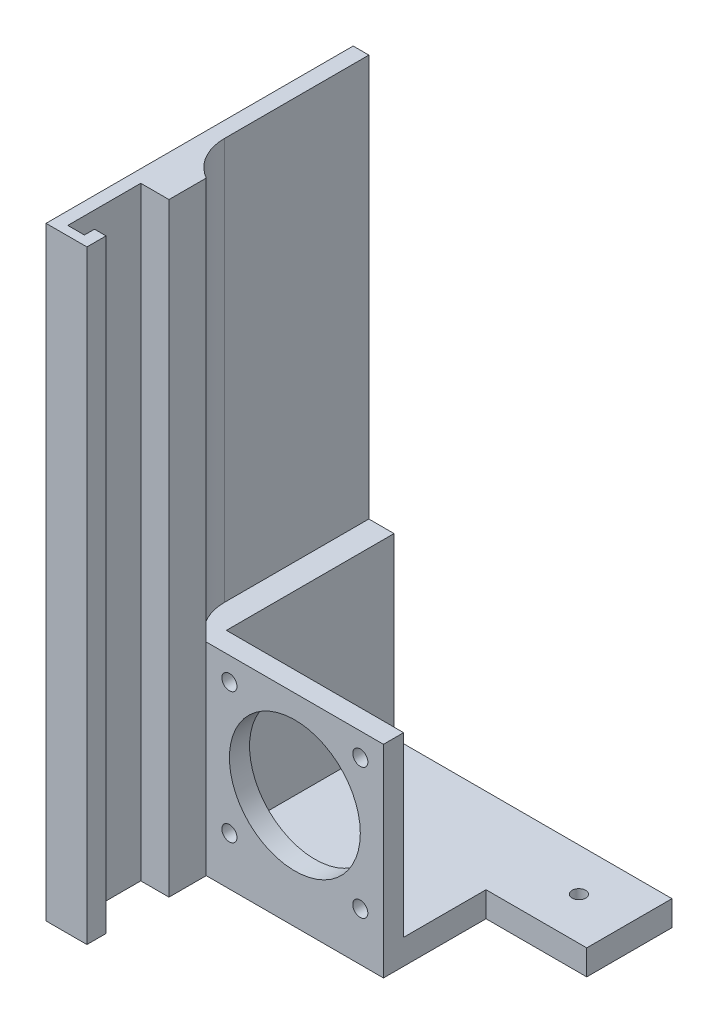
ISO-10303-21;
HEADER;
FILE_DESCRIPTION(('STEP AP214'),'2;1');
FILE_NAME('part.step','',(''),(''),'','','');
FILE_SCHEMA(('AUTOMOTIVE_DESIGN { 1 0 10303 214 1 1 1 1 }'));
ENDSEC;
DATA;
#1=APPLICATION_CONTEXT('core data for automotive mechanical design processes');
#2=APPLICATION_PROTOCOL_DEFINITION('international standard','automotive_design',2000,#1);
#3=PRODUCT_CONTEXT('',#1,'mechanical');
#4=PRODUCT('Part','Part','',(#3));
#5=PRODUCT_RELATED_PRODUCT_CATEGORY('part','',(#4));
#6=PRODUCT_DEFINITION_FORMATION('','',#4);
#7=PRODUCT_DEFINITION_CONTEXT('part definition',#1,'design');
#8=PRODUCT_DEFINITION('design','',#6,#7);
#9=PRODUCT_DEFINITION_SHAPE('','',#8);
#10=(LENGTH_UNIT() NAMED_UNIT(*) SI_UNIT(.MILLI.,.METRE.));
#11=(NAMED_UNIT(*) PLANE_ANGLE_UNIT() SI_UNIT($,.RADIAN.));
#12=(NAMED_UNIT(*) SI_UNIT($,.STERADIAN.) SOLID_ANGLE_UNIT());
#13=UNCERTAINTY_MEASURE_WITH_UNIT(LENGTH_MEASURE(1.E-05),#10,'distance_accuracy_value','');
#14=(GEOMETRIC_REPRESENTATION_CONTEXT(3) GLOBAL_UNCERTAINTY_ASSIGNED_CONTEXT((#13)) GLOBAL_UNIT_ASSIGNED_CONTEXT((#10,
#11,#12)) REPRESENTATION_CONTEXT('',''));
#15=CARTESIAN_POINT('',(0.,0.,0.));
#16=DIRECTION('',(0.,0.,1.));
#17=DIRECTION('',(1.,0.,0.));
#18=AXIS2_PLACEMENT_3D('',#15,#16,#17);
#19=CARTESIAN_POINT('',(-25.72,0.,0.));
#20=DIRECTION('',(1.,0.,0.));
#21=DIRECTION('',(0.,1.,0.));
#22=AXIS2_PLACEMENT_3D('',#19,#20,#21);
#23=PLANE('',#22);
#24=DIRECTION('',(0.,0.,-1.));
#25=VECTOR('',#24,1.);
#26=CARTESIAN_POINT('',(-25.72,-17.6,-33.3));
#27=LINE('',#26,#25);
#28=CARTESIAN_POINT('',(-25.72,-17.6,-16.37));
#29=VERTEX_POINT('',#28);
#30=CARTESIAN_POINT('',(-25.72,-17.6,-33.3));
#31=VERTEX_POINT('',#30);
#32=EDGE_CURVE('E218',#29,#31,#27,.T.);
#33=ORIENTED_EDGE('',*,*,#32,.F.);
#34=DIRECTION('',(0.,1.,0.));
#35=VECTOR('',#34,1.);
#36=CARTESIAN_POINT('',(-25.72,-17.6,-16.37));
#37=LINE('',#36,#35);
#38=CARTESIAN_POINT('',(-25.72,-22.6,-16.37));
#39=VERTEX_POINT('',#38);
#40=EDGE_CURVE('E54',#39,#29,#37,.T.);
#41=ORIENTED_EDGE('',*,*,#40,.F.);
#42=DIRECTION('',(0.,0.,1.));
#43=VECTOR('',#42,1.);
#44=CARTESIAN_POINT('',(-25.72,-22.6,-33.3));
#45=LINE('',#44,#43);
#46=CARTESIAN_POINT('',(-25.72,-22.6,27.7));
#47=VERTEX_POINT('',#46);
#48=EDGE_CURVE('E329',#39,#47,#45,.T.);
#49=ORIENTED_EDGE('',*,*,#48,.T.);
#50=DIRECTION('',(0.,-1.,0.));
#51=VECTOR('',#50,1.);
#52=CARTESIAN_POINT('',(-25.72,157.4,27.7));
#53=LINE('',#52,#51);
#54=CARTESIAN_POINT('',(-25.72,97.4,27.7));
#55=VERTEX_POINT('',#54);
#56=EDGE_CURVE('E321',#55,#47,#53,.T.);
#57=ORIENTED_EDGE('',*,*,#56,.F.);
#58=DIRECTION('',(0.,0.,-1.));
#59=VECTOR('',#58,1.);
#60=CARTESIAN_POINT('',(-25.72,97.4,0.));
#61=LINE('',#60,#59);
#62=CARTESIAN_POINT('',(-25.72,97.4,-33.3));
#63=VERTEX_POINT('',#62);
#64=EDGE_CURVE('E281',#55,#63,#61,.T.);
#65=ORIENTED_EDGE('',*,*,#64,.T.);
#66=DIRECTION('',(0.,-1.,0.));
#67=VECTOR('',#66,1.);
#68=CARTESIAN_POINT('',(-25.72,-22.6,-33.3));
#69=LINE('',#68,#67);
#70=EDGE_CURVE('E60',#63,#31,#69,.T.);
#71=ORIENTED_EDGE('',*,*,#70,.T.);
#72=EDGE_LOOP('',(#33,#41,#49,#57,#65,#71));
#73=FACE_BOUND('',#72,.T.);
#74=ADVANCED_FACE('F39',(#73),#23,.F.);
#75=CARTESIAN_POINT('',(17.6,17.6,4.));
#76=DIRECTION('',(-1.,0.,0.));
#77=DIRECTION('',(0.,-1.,0.));
#78=AXIS2_PLACEMENT_3D('',#75,#76,#77);
#79=PLANE('',#78);
#80=DIRECTION('',(0.,-1.,0.));
#81=VECTOR('',#80,1.);
#82=CARTESIAN_POINT('',(17.6,-17.6,-16.37));
#83=LINE('',#82,#81);
#84=CARTESIAN_POINT('',(17.6,-17.6,-16.37));
#85=VERTEX_POINT('',#84);
#86=CARTESIAN_POINT('',(17.6,-22.6,-16.37));
#87=VERTEX_POINT('',#86);
#88=EDGE_CURVE('E240',#85,#87,#83,.T.);
#89=ORIENTED_EDGE('',*,*,#88,.F.);
#90=DIRECTION('',(0.,0.,-1.));
#91=VECTOR('',#90,1.);
#92=CARTESIAN_POINT('',(17.6,-17.6,4.));
#93=LINE('',#92,#91);
#94=CARTESIAN_POINT('',(17.6,-17.6,0.));
#95=VERTEX_POINT('',#94);
#96=EDGE_CURVE('E343',#95,#85,#93,.T.);
#97=ORIENTED_EDGE('',*,*,#96,.F.);
#98=DIRECTION('',(0.,1.,0.));
#99=VECTOR('',#98,1.);
#100=CARTESIAN_POINT('',(17.6,17.6,0.));
#101=LINE('',#100,#99);
#102=CARTESIAN_POINT('',(17.6,17.6,0.));
#103=VERTEX_POINT('',#102);
#104=EDGE_CURVE('E381',#95,#103,#101,.T.);
#105=ORIENTED_EDGE('',*,*,#104,.T.);
#106=DIRECTION('',(0.,0.,-1.));
#107=VECTOR('',#106,1.);
#108=CARTESIAN_POINT('',(17.6,17.6,4.));
#109=LINE('',#108,#107);
#110=CARTESIAN_POINT('',(17.6,17.6,4.));
#111=VERTEX_POINT('',#110);
#112=EDGE_CURVE('E391',#111,#103,#109,.T.);
#113=ORIENTED_EDGE('',*,*,#112,.F.);
#114=DIRECTION('',(0.,1.,0.));
#115=VECTOR('',#114,1.);
#116=CARTESIAN_POINT('',(17.6,17.6,4.));
#117=LINE('',#116,#115);
#118=CARTESIAN_POINT('',(17.6,-22.6,4.));
#119=VERTEX_POINT('',#118);
#120=EDGE_CURVE('E384',#119,#111,#117,.T.);
#121=ORIENTED_EDGE('',*,*,#120,.F.);
#122=DIRECTION('',(0.,0.,-1.));
#123=VECTOR('',#122,1.);
#124=CARTESIAN_POINT('',(17.6,-22.6,4.));
#125=LINE('',#124,#123);
#126=EDGE_CURVE('E202',#119,#87,#125,.T.);
#127=ORIENTED_EDGE('',*,*,#126,.T.);
#128=EDGE_LOOP('',(#89,#97,#105,#113,#121,#127));
#129=FACE_BOUND('',#128,.T.);
#130=ADVANCED_FACE('F464',(#129),#79,.F.);
#131=CARTESIAN_POINT('',(-22.6,0.,0.));
#132=DIRECTION('',(1.,0.,0.));
#133=DIRECTION('',(0.,1.,0.));
#134=AXIS2_PLACEMENT_3D('',#131,#132,#133);
#135=PLANE('',#134);
#136=DIRECTION('',(0.,0.,-1.));
#137=VECTOR('',#136,1.);
#138=CARTESIAN_POINT('',(-22.6,97.4,0.));
#139=LINE('',#138,#137);
#140=CARTESIAN_POINT('',(-22.6,97.4,-4.66025403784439));
#141=VERTEX_POINT('',#140);
#142=CARTESIAN_POINT('',(-22.6,97.4,-33.3));
#143=VERTEX_POINT('',#142);
#144=EDGE_CURVE('E279',#141,#143,#139,.T.);
#145=ORIENTED_EDGE('',*,*,#144,.F.);
#146=DIRECTION('',(0.,-1.,0.));
#147=VECTOR('',#146,1.);
#148=CARTESIAN_POINT('',(-22.6,17.6,-4.66025403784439));
#149=LINE('',#148,#147);
#150=CARTESIAN_POINT('',(-22.6,17.6,-4.66025403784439));
#151=VERTEX_POINT('',#150);
#152=EDGE_CURVE('E403',#141,#151,#149,.T.);
#153=ORIENTED_EDGE('',*,*,#152,.T.);
#154=DIRECTION('',(0.,0.,-1.));
#155=VECTOR('',#154,1.);
#156=CARTESIAN_POINT('',(-22.6,17.6,4.));
#157=LINE('',#156,#155);
#158=CARTESIAN_POINT('',(-22.6,17.6,-33.3));
#159=VERTEX_POINT('',#158);
#160=EDGE_CURVE('E333',#151,#159,#157,.T.);
#161=ORIENTED_EDGE('',*,*,#160,.T.);
#162=DIRECTION('',(0.,-1.,0.));
#163=VECTOR('',#162,1.);
#164=CARTESIAN_POINT('',(-22.6,-22.6,-33.3));
#165=LINE('',#164,#163);
#166=EDGE_CURVE('E327',#143,#159,#165,.T.);
#167=ORIENTED_EDGE('',*,*,#166,.F.);
#168=EDGE_LOOP('',(#145,#153,#161,#167));
#169=FACE_BOUND('',#168,.T.);
#170=ADVANCED_FACE('F429',(#169),#135,.T.);
#171=CARTESIAN_POINT('',(0.,0.,4.));
#172=DIRECTION('',(0.,0.,1.));
#173=DIRECTION('',(1.,0.,0.));
#174=AXIS2_PLACEMENT_3D('',#171,#172,#173);
#175=PLANE('',#174);
#176=DIRECTION('',(0.,1.,0.));
#177=VECTOR('',#176,1.);
#178=CARTESIAN_POINT('',(-17.6,-22.6,4.));
#179=LINE('',#178,#177);
#180=CARTESIAN_POINT('',(-17.6,-22.6,4.));
#181=VERTEX_POINT('',#180);
#182=CARTESIAN_POINT('',(-17.6,17.6,4.));
#183=VERTEX_POINT('',#182);
#184=EDGE_CURVE('E301',#181,#183,#179,.T.);
#185=ORIENTED_EDGE('',*,*,#184,.F.);
#186=DIRECTION('',(1.,0.,0.));
#187=VECTOR('',#186,1.);
#188=CARTESIAN_POINT('',(-17.6,-22.6,4.));
#189=LINE('',#188,#187);
#190=EDGE_CURVE('E344',#181,#119,#189,.T.);
#191=ORIENTED_EDGE('',*,*,#190,.T.);
#192=ORIENTED_EDGE('',*,*,#120,.T.);
#193=DIRECTION('',(-1.,0.,0.));
#194=VECTOR('',#193,1.);
#195=CARTESIAN_POINT('',(-17.6,17.6,4.));
#196=LINE('',#195,#194);
#197=EDGE_CURVE('E387',#111,#183,#196,.T.);
#198=ORIENTED_EDGE('',*,*,#197,.T.);
#199=EDGE_LOOP('',(#185,#191,#192,#198));
#200=FACE_BOUND('',#199,.T.);
#201=CARTESIAN_POINT('',(12.9966226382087,12.9966226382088,4.));
#202=DIRECTION('',(0.,0.,1.));
#203=DIRECTION('',(1.,0.,0.));
#204=AXIS2_PLACEMENT_3D('',#201,#202,#203);
#205=CIRCLE('',#204,1.5);
#206=CARTESIAN_POINT('',(14.4966226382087,12.9966226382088,4.));
#207=VERTEX_POINT('',#206);
#208=EDGE_CURVE('E360',#207,#207,#205,.T.);
#209=ORIENTED_EDGE('',*,*,#208,.F.);
#210=EDGE_LOOP('',(#209));
#211=FACE_BOUND('',#210,.T.);
#212=CARTESIAN_POINT('',(12.9966226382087,-12.9966226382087,4.));
#213=DIRECTION('',(0.,0.,1.));
#214=DIRECTION('',(1.,0.,0.));
#215=AXIS2_PLACEMENT_3D('',#212,#213,#214);
#216=CIRCLE('',#215,1.5);
#217=CARTESIAN_POINT('',(14.4966226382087,-12.9966226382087,4.));
#218=VERTEX_POINT('',#217);
#219=EDGE_CURVE('E372',#218,#218,#216,.T.);
#220=ORIENTED_EDGE('',*,*,#219,.F.);
#221=EDGE_LOOP('',(#220));
#222=FACE_BOUND('',#221,.T.);
#223=CARTESIAN_POINT('',(-12.9966226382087,-12.9966226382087,4.));
#224=DIRECTION('',(0.,0.,1.));
#225=DIRECTION('',(1.,0.,0.));
#226=AXIS2_PLACEMENT_3D('',#223,#224,#225);
#227=CIRCLE('',#226,1.5);
#228=CARTESIAN_POINT('',(-11.4966226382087,-12.9966226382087,4.));
#229=VERTEX_POINT('',#228);
#230=EDGE_CURVE('E378',#229,#229,#227,.T.);
#231=ORIENTED_EDGE('',*,*,#230,.F.);
#232=EDGE_LOOP('',(#231));
#233=FACE_BOUND('',#232,.T.);
#234=CARTESIAN_POINT('',(-12.9966226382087,12.9966226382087,4.));
#235=DIRECTION('',(0.,0.,1.));
#236=DIRECTION('',(1.,0.,0.));
#237=AXIS2_PLACEMENT_3D('',#234,#235,#236);
#238=CIRCLE('',#237,1.5);
#239=CARTESIAN_POINT('',(-11.4966226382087,12.9966226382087,4.));
#240=VERTEX_POINT('',#239);
#241=EDGE_CURVE('E366',#240,#240,#238,.T.);
#242=ORIENTED_EDGE('',*,*,#241,.F.);
#243=EDGE_LOOP('',(#242));
#244=FACE_BOUND('',#243,.T.);
#245=CARTESIAN_POINT('',(0.,0.,4.));
#246=DIRECTION('',(0.,0.,1.));
#247=DIRECTION('',(1.,0.,0.));
#248=AXIS2_PLACEMENT_3D('',#245,#246,#247);
#249=CIRCLE('',#248,13.);
#250=CARTESIAN_POINT('',(13.,0.,4.));
#251=VERTEX_POINT('',#250);
#252=EDGE_CURVE('E354',#251,#251,#249,.T.);
#253=ORIENTED_EDGE('',*,*,#252,.F.);
#254=EDGE_LOOP('',(#253));
#255=FACE_BOUND('',#254,.T.);
#256=ADVANCED_FACE('F420',(#200,#211,#222,#233,#244,#255),#175,.T.);
#257=CARTESIAN_POINT('',(0.,0.,0.));
#258=DIRECTION('',(0.,0.,1.));
#259=DIRECTION('',(1.,0.,0.));
#260=AXIS2_PLACEMENT_3D('',#257,#258,#259);
#261=PLANE('',#260);
#262=ORIENTED_EDGE('',*,*,#104,.F.);
#263=DIRECTION('',(1.,0.,0.));
#264=VECTOR('',#263,1.);
#265=CARTESIAN_POINT('',(-17.6,-17.6,0.));
#266=LINE('',#265,#264);
#267=CARTESIAN_POINT('',(-17.6,-17.6,0.));
#268=VERTEX_POINT('',#267);
#269=EDGE_CURVE('E388',#268,#95,#266,.T.);
#270=ORIENTED_EDGE('',*,*,#269,.F.);
#271=DIRECTION('',(0.,-1.,0.));
#272=VECTOR('',#271,1.);
#273=CARTESIAN_POINT('',(-17.6,17.6,0.));
#274=LINE('',#273,#272);
#275=CARTESIAN_POINT('',(-17.6,17.6,0.));
#276=VERTEX_POINT('',#275);
#277=EDGE_CURVE('E396',#276,#268,#274,.T.);
#278=ORIENTED_EDGE('',*,*,#277,.F.);
#279=DIRECTION('',(-1.,0.,0.));
#280=VECTOR('',#279,1.);
#281=CARTESIAN_POINT('',(-17.6,17.6,0.));
#282=LINE('',#281,#280);
#283=EDGE_CURVE('E394',#103,#276,#282,.T.);
#284=ORIENTED_EDGE('',*,*,#283,.F.);
#285=EDGE_LOOP('',(#262,#270,#278,#284));
#286=FACE_BOUND('',#285,.T.);
#287=CARTESIAN_POINT('',(-12.9966226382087,-12.9966226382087,0.));
#288=DIRECTION('',(0.,0.,1.));
#289=DIRECTION('',(1.,0.,0.));
#290=AXIS2_PLACEMENT_3D('',#287,#288,#289);
#291=CIRCLE('',#290,1.5);
#292=CARTESIAN_POINT('',(-11.4966226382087,-12.9966226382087,0.));
#293=VERTEX_POINT('',#292);
#294=EDGE_CURVE('E375',#293,#293,#291,.T.);
#295=ORIENTED_EDGE('',*,*,#294,.T.);
#296=EDGE_LOOP('',(#295));
#297=FACE_BOUND('',#296,.T.);
#298=CARTESIAN_POINT('',(12.9966226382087,-12.9966226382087,0.));
#299=DIRECTION('',(0.,0.,1.));
#300=DIRECTION('',(1.,0.,0.));
#301=AXIS2_PLACEMENT_3D('',#298,#299,#300);
#302=CIRCLE('',#301,1.5);
#303=CARTESIAN_POINT('',(14.4966226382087,-12.9966226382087,0.));
#304=VERTEX_POINT('',#303);
#305=EDGE_CURVE('E369',#304,#304,#302,.T.);
#306=ORIENTED_EDGE('',*,*,#305,.T.);
#307=EDGE_LOOP('',(#306));
#308=FACE_BOUND('',#307,.T.);
#309=CARTESIAN_POINT('',(-12.9966226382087,12.9966226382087,0.));
#310=DIRECTION('',(0.,0.,1.));
#311=DIRECTION('',(1.,0.,0.));
#312=AXIS2_PLACEMENT_3D('',#309,#310,#311);
#313=CIRCLE('',#312,1.5);
#314=CARTESIAN_POINT('',(-11.4966226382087,12.9966226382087,0.));
#315=VERTEX_POINT('',#314);
#316=EDGE_CURVE('E363',#315,#315,#313,.T.);
#317=ORIENTED_EDGE('',*,*,#316,.T.);
#318=EDGE_LOOP('',(#317));
#319=FACE_BOUND('',#318,.T.);
#320=CARTESIAN_POINT('',(12.9966226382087,12.9966226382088,0.));
#321=DIRECTION('',(0.,0.,1.));
#322=DIRECTION('',(1.,0.,0.));
#323=AXIS2_PLACEMENT_3D('',#320,#321,#322);
#324=CIRCLE('',#323,1.5);
#325=CARTESIAN_POINT('',(14.4966226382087,12.9966226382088,0.));
#326=VERTEX_POINT('',#325);
#327=EDGE_CURVE('E357',#326,#326,#324,.T.);
#328=ORIENTED_EDGE('',*,*,#327,.T.);
#329=EDGE_LOOP('',(#328));
#330=FACE_BOUND('',#329,.T.);
#331=CARTESIAN_POINT('',(0.,0.,0.));
#332=DIRECTION('',(0.,0.,1.));
#333=DIRECTION('',(1.,0.,0.));
#334=AXIS2_PLACEMENT_3D('',#331,#332,#333);
#335=CIRCLE('',#334,13.);
#336=CARTESIAN_POINT('',(13.,0.,0.));
#337=VERTEX_POINT('',#336);
#338=EDGE_CURVE('E201',#337,#337,#335,.T.);
#339=ORIENTED_EDGE('',*,*,#338,.T.);
#340=EDGE_LOOP('',(#339));
#341=FACE_BOUND('',#340,.T.);
#342=ADVANCED_FACE('F469',(#286,#297,#308,#319,#330,#341),#261,.F.);
#343=CARTESIAN_POINT('',(-17.6,17.6,4.));
#344=DIRECTION('',(0.,-1.,0.));
#345=DIRECTION('',(0.,0.,-1.));
#346=AXIS2_PLACEMENT_3D('',#343,#344,#345);
#347=PLANE('',#346);
#348=ORIENTED_EDGE('',*,*,#160,.F.);
#349=CARTESIAN_POINT('',(-12.6,17.6,-4.66025403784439));
#350=DIRECTION('',(0.,-1.,0.));
#351=DIRECTION('',(0.,0.,-1.));
#352=AXIS2_PLACEMENT_3D('',#349,#350,#351);
#353=CIRCLE('',#352,10.);
#354=EDGE_CURVE('E47',#151,#183,#353,.F.);
#355=ORIENTED_EDGE('',*,*,#354,.T.);
#356=ORIENTED_EDGE('',*,*,#197,.F.);
#357=ORIENTED_EDGE('',*,*,#112,.T.);
#358=ORIENTED_EDGE('',*,*,#283,.T.);
#359=DIRECTION('',(0.,0.,-1.));
#360=VECTOR('',#359,1.);
#361=CARTESIAN_POINT('',(-17.6,17.6,4.));
#362=LINE('',#361,#360);
#363=CARTESIAN_POINT('',(-17.6,17.6,-33.3));
#364=VERTEX_POINT('',#363);
#365=EDGE_CURVE('E331',#276,#364,#362,.T.);
#366=ORIENTED_EDGE('',*,*,#365,.T.);
#367=DIRECTION('',(1.,0.,0.));
#368=VECTOR('',#367,1.);
#369=CARTESIAN_POINT('',(-22.6,17.6,-33.3));
#370=LINE('',#369,#368);
#371=EDGE_CURVE('E336',#159,#364,#370,.T.);
#372=ORIENTED_EDGE('',*,*,#371,.F.);
#373=EDGE_LOOP('',(#348,#355,#356,#357,#358,#366,#372));
#374=FACE_BOUND('',#373,.T.);
#375=ADVANCED_FACE('F407',(#374),#347,.F.);
#376=CARTESIAN_POINT('',(-12.9966226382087,-12.9966226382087,4.));
#377=DIRECTION('',(0.,0.,-1.));
#378=DIRECTION('',(-1.,0.,0.));
#379=AXIS2_PLACEMENT_3D('',#376,#377,#378);
#380=CYLINDRICAL_SURFACE('',#379,1.5);
#381=ORIENTED_EDGE('',*,*,#230,.T.);
#382=EDGE_LOOP('',(#381));
#383=FACE_BOUND('',#382,.T.);
#384=ORIENTED_EDGE('',*,*,#294,.F.);
#385=EDGE_LOOP('',(#384));
#386=FACE_BOUND('',#385,.T.);
#387=ADVANCED_FACE('F529',(#383,#386),#380,.F.);
#388=CARTESIAN_POINT('',(12.9966226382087,-12.9966226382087,4.));
#389=DIRECTION('',(0.,0.,-1.));
#390=DIRECTION('',(-1.,0.,0.));
#391=AXIS2_PLACEMENT_3D('',#388,#389,#390);
#392=CYLINDRICAL_SURFACE('',#391,1.5);
#393=ORIENTED_EDGE('',*,*,#219,.T.);
#394=EDGE_LOOP('',(#393));
#395=FACE_BOUND('',#394,.T.);
#396=ORIENTED_EDGE('',*,*,#305,.F.);
#397=EDGE_LOOP('',(#396));
#398=FACE_BOUND('',#397,.T.);
#399=ADVANCED_FACE('F525',(#395,#398),#392,.F.);
#400=CARTESIAN_POINT('',(-12.9966226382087,12.9966226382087,4.));
#401=DIRECTION('',(0.,0.,-1.));
#402=DIRECTION('',(-1.,0.,0.));
#403=AXIS2_PLACEMENT_3D('',#400,#401,#402);
#404=CYLINDRICAL_SURFACE('',#403,1.5);
#405=ORIENTED_EDGE('',*,*,#241,.T.);
#406=EDGE_LOOP('',(#405));
#407=FACE_BOUND('',#406,.T.);
#408=ORIENTED_EDGE('',*,*,#316,.F.);
#409=EDGE_LOOP('',(#408));
#410=FACE_BOUND('',#409,.T.);
#411=ADVANCED_FACE('F521',(#407,#410),#404,.F.);
#412=CARTESIAN_POINT('',(12.9966226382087,12.9966226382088,4.));
#413=DIRECTION('',(0.,0.,-1.));
#414=DIRECTION('',(-1.,0.,0.));
#415=AXIS2_PLACEMENT_3D('',#412,#413,#414);
#416=CYLINDRICAL_SURFACE('',#415,1.5);
#417=ORIENTED_EDGE('',*,*,#208,.T.);
#418=EDGE_LOOP('',(#417));
#419=FACE_BOUND('',#418,.T.);
#420=ORIENTED_EDGE('',*,*,#327,.F.);
#421=EDGE_LOOP('',(#420));
#422=FACE_BOUND('',#421,.T.);
#423=ADVANCED_FACE('F517',(#419,#422),#416,.F.);
#424=CARTESIAN_POINT('',(0.,0.,4.));
#425=DIRECTION('',(0.,0.,-1.));
#426=DIRECTION('',(-1.,0.,0.));
#427=AXIS2_PLACEMENT_3D('',#424,#425,#426);
#428=CYLINDRICAL_SURFACE('',#427,13.);
#429=ORIENTED_EDGE('',*,*,#252,.T.);
#430=EDGE_LOOP('',(#429));
#431=FACE_BOUND('',#430,.T.);
#432=ORIENTED_EDGE('',*,*,#338,.F.);
#433=EDGE_LOOP('',(#432));
#434=FACE_BOUND('',#433,.T.);
#435=ADVANCED_FACE('F514',(#431,#434),#428,.F.);
#436=CARTESIAN_POINT('',(-17.6,-22.6,-33.3));
#437=DIRECTION('',(0.,0.,1.));
#438=DIRECTION('',(1.,0.,0.));
#439=AXIS2_PLACEMENT_3D('',#436,#437,#438);
#440=PLANE('',#439);
#441=ORIENTED_EDGE('',*,*,#70,.F.);
#442=DIRECTION('',(1.,0.,0.));
#443=VECTOR('',#442,1.);
#444=CARTESIAN_POINT('',(-37.6,97.4,-33.3));
#445=LINE('',#444,#443);
#446=EDGE_CURVE('E260',#63,#143,#445,.T.);
#447=ORIENTED_EDGE('',*,*,#446,.T.);
#448=ORIENTED_EDGE('',*,*,#166,.T.);
#449=ORIENTED_EDGE('',*,*,#371,.T.);
#450=DIRECTION('',(0.,-1.,0.));
#451=VECTOR('',#450,1.);
#452=CARTESIAN_POINT('',(-17.6,-22.6,-33.3));
#453=LINE('',#452,#451);
#454=CARTESIAN_POINT('',(-17.6,-17.6,-33.3));
#455=VERTEX_POINT('',#454);
#456=EDGE_CURVE('E337',#364,#455,#453,.T.);
#457=ORIENTED_EDGE('',*,*,#456,.T.);
#458=DIRECTION('',(1.,0.,0.));
#459=VECTOR('',#458,1.);
#460=CARTESIAN_POINT('',(-17.6,-17.6,-33.3));
#461=LINE('',#460,#459);
#462=CARTESIAN_POINT('',(37.6,-17.6,-33.3));
#463=VERTEX_POINT('',#462);
#464=EDGE_CURVE('E350',#455,#463,#461,.T.);
#465=ORIENTED_EDGE('',*,*,#464,.T.);
#466=DIRECTION('',(0.,1.,0.));
#467=VECTOR('',#466,1.);
#468=CARTESIAN_POINT('',(37.6,-17.6,-33.3));
#469=LINE('',#468,#467);
#470=CARTESIAN_POINT('',(37.6,-22.6,-33.3));
#471=VERTEX_POINT('',#470);
#472=EDGE_CURVE('E197',#471,#463,#469,.T.);
#473=ORIENTED_EDGE('',*,*,#472,.F.);
#474=DIRECTION('',(1.,0.,0.));
#475=VECTOR('',#474,1.);
#476=CARTESIAN_POINT('',(-17.6,-22.6,-33.3));
#477=LINE('',#476,#475);
#478=CARTESIAN_POINT('',(-45.8,-22.6,-33.3));
#479=VERTEX_POINT('',#478);
#480=EDGE_CURVE('E190',#479,#471,#477,.T.);
#481=ORIENTED_EDGE('',*,*,#480,.F.);
#482=DIRECTION('',(0.,-1.,0.));
#483=VECTOR('',#482,1.);
#484=CARTESIAN_POINT('',(-45.8,-17.6,-33.3));
#485=LINE('',#484,#483);
#486=CARTESIAN_POINT('',(-45.8,-17.6,-33.3));
#487=VERTEX_POINT('',#486);
#488=EDGE_CURVE('E195',#487,#479,#485,.T.);
#489=ORIENTED_EDGE('',*,*,#488,.F.);
#490=DIRECTION('',(1.,0.,0.));
#491=VECTOR('',#490,1.);
#492=CARTESIAN_POINT('',(-45.8,-17.6,-33.3));
#493=LINE('',#492,#491);
#494=EDGE_CURVE('E227',#487,#31,#493,.T.);
#495=ORIENTED_EDGE('',*,*,#494,.T.);
#496=EDGE_LOOP('',(#441,#447,#448,#449,#457,#465,#473,#481,#489,#495));
#497=FACE_BOUND('',#496,.T.);
#498=ADVANCED_FACE('F192',(#497),#440,.F.);
#499=CARTESIAN_POINT('',(0.,-22.6,0.));
#500=DIRECTION('',(0.,1.,0.));
#501=DIRECTION('',(0.,0.,1.));
#502=AXIS2_PLACEMENT_3D('',#499,#500,#501);
#503=PLANE('',#502);
#504=CARTESIAN_POINT('',(-35.8,-22.6,-24.84));
#505=DIRECTION('',(0.,1.,0.));
#506=DIRECTION('',(0.,0.,1.));
#507=AXIS2_PLACEMENT_3D('',#504,#505,#506);
#508=CIRCLE('',#507,1.35);
#509=CARTESIAN_POINT('',(-35.8,-22.6,-23.49));
#510=VERTEX_POINT('',#509);
#511=EDGE_CURVE('E222',#510,#510,#508,.T.);
#512=ORIENTED_EDGE('',*,*,#511,.T.);
#513=EDGE_LOOP('',(#512));
#514=FACE_BOUND('',#513,.T.);
#515=CARTESIAN_POINT('',(27.6,-22.6,-24.83));
#516=DIRECTION('',(0.,1.,0.));
#517=DIRECTION('',(0.,0.,1.));
#518=AXIS2_PLACEMENT_3D('',#515,#516,#517);
#519=CIRCLE('',#518,1.35000000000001);
#520=CARTESIAN_POINT('',(27.6,-22.6,-23.48));
#521=VERTEX_POINT('',#520);
#522=EDGE_CURVE('E237',#521,#521,#519,.T.);
#523=ORIENTED_EDGE('',*,*,#522,.T.);
#524=EDGE_LOOP('',(#523));
#525=FACE_BOUND('',#524,.T.);
#526=DIRECTION('',(-1.,0.,0.));
#527=VECTOR('',#526,1.);
#528=CARTESIAN_POINT('',(-19.6,-22.6,25.9));
#529=LINE('',#528,#527);
#530=CARTESIAN_POINT('',(-19.9,-22.6,25.9));
#531=VERTEX_POINT('',#530);
#532=CARTESIAN_POINT('',(-23.2,-22.6,25.9));
#533=VERTEX_POINT('',#532);
#534=EDGE_CURVE('E319',#531,#533,#529,.T.);
#535=ORIENTED_EDGE('',*,*,#534,.F.);
#536=DIRECTION('',(0.,0.,1.));
#537=VECTOR('',#536,1.);
#538=CARTESIAN_POINT('',(-19.9,-22.6,23.9));
#539=LINE('',#538,#537);
#540=CARTESIAN_POINT('',(-19.9,-22.6,23.9));
#541=VERTEX_POINT('',#540);
#542=EDGE_CURVE('E283',#541,#531,#539,.T.);
#543=ORIENTED_EDGE('',*,*,#542,.F.);
#544=DIRECTION('',(-1.,0.,0.));
#545=VECTOR('',#544,1.);
#546=CARTESIAN_POINT('',(-17.6,-22.6,23.9));
#547=LINE('',#546,#545);
#548=CARTESIAN_POINT('',(-17.6,-22.6,23.9));
#549=VERTEX_POINT('',#548);
#550=EDGE_CURVE('E317',#549,#541,#547,.T.);
#551=ORIENTED_EDGE('',*,*,#550,.F.);
#552=DIRECTION('',(0.,0.,-1.));
#553=VECTOR('',#552,1.);
#554=CARTESIAN_POINT('',(-17.6,-22.6,27.7));
#555=LINE('',#554,#553);
#556=CARTESIAN_POINT('',(-17.6,-22.6,27.7));
#557=VERTEX_POINT('',#556);
#558=EDGE_CURVE('E312',#557,#549,#555,.T.);
#559=ORIENTED_EDGE('',*,*,#558,.F.);
#560=DIRECTION('',(1.,0.,0.));
#561=VECTOR('',#560,1.);
#562=CARTESIAN_POINT('',(-22.6,-22.6,27.7));
#563=LINE('',#562,#561);
#564=EDGE_CURVE('E324',#47,#557,#563,.T.);
#565=ORIENTED_EDGE('',*,*,#564,.F.);
#566=ORIENTED_EDGE('',*,*,#48,.F.);
#567=DIRECTION('',(1.,0.,0.));
#568=VECTOR('',#567,1.);
#569=CARTESIAN_POINT('',(-45.8,-22.6,-16.37));
#570=LINE('',#569,#568);
#571=CARTESIAN_POINT('',(-45.8,-22.6,-16.37));
#572=VERTEX_POINT('',#571);
#573=EDGE_CURVE('E209',#572,#39,#570,.T.);
#574=ORIENTED_EDGE('',*,*,#573,.F.);
#575=DIRECTION('',(0.,0.,1.));
#576=VECTOR('',#575,1.);
#577=CARTESIAN_POINT('',(-45.8,-22.6,-33.3));
#578=LINE('',#577,#576);
#579=EDGE_CURVE('E205',#479,#572,#578,.T.);
#580=ORIENTED_EDGE('',*,*,#579,.F.);
#581=ORIENTED_EDGE('',*,*,#480,.T.);
#582=DIRECTION('',(0.,0.,-1.));
#583=VECTOR('',#582,1.);
#584=CARTESIAN_POINT('',(37.6,-22.6,-33.3));
#585=LINE('',#584,#583);
#586=CARTESIAN_POINT('',(37.6,-22.6,-16.37));
#587=VERTEX_POINT('',#586);
#588=EDGE_CURVE('E246',#587,#471,#585,.T.);
#589=ORIENTED_EDGE('',*,*,#588,.F.);
#590=DIRECTION('',(-1.,0.,0.));
#591=VECTOR('',#590,1.);
#592=CARTESIAN_POINT('',(37.6,-22.6,-16.37));
#593=LINE('',#592,#591);
#594=EDGE_CURVE('E248',#587,#87,#593,.T.);
#595=ORIENTED_EDGE('',*,*,#594,.T.);
#596=ORIENTED_EDGE('',*,*,#126,.F.);
#597=ORIENTED_EDGE('',*,*,#190,.F.);
#598=DIRECTION('',(0.,0.,-1.));
#599=VECTOR('',#598,1.);
#600=CARTESIAN_POINT('',(-17.6,-22.6,4.));
#601=LINE('',#600,#599);
#602=CARTESIAN_POINT('',(-17.6,-22.6,11.4));
#603=VERTEX_POINT('',#602);
#604=EDGE_CURVE('E306',#603,#181,#601,.T.);
#605=ORIENTED_EDGE('',*,*,#604,.F.);
#606=DIRECTION('',(-1.,0.,0.));
#607=VECTOR('',#606,1.);
#608=CARTESIAN_POINT('',(-17.6,-22.6,11.4));
#609=LINE('',#608,#607);
#610=CARTESIAN_POINT('',(-23.2,-22.6,11.4));
#611=VERTEX_POINT('',#610);
#612=EDGE_CURVE('E308',#603,#611,#609,.T.);
#613=ORIENTED_EDGE('',*,*,#612,.T.);
#614=DIRECTION('',(0.,0.,1.));
#615=VECTOR('',#614,1.);
#616=CARTESIAN_POINT('',(-23.2,-22.6,0.));
#617=LINE('',#616,#615);
#618=EDGE_CURVE('E295',#611,#533,#617,.T.);
#619=ORIENTED_EDGE('',*,*,#618,.T.);
#620=EDGE_LOOP('',(#535,#543,#551,#559,#565,#566,#574,#580,#581,#589,#595,#596,#597,#605,#613,#619));
#621=FACE_BOUND('',#620,.T.);
#622=ADVANCED_FACE('F207',(#514,#525,#621),#503,.F.);
#623=CARTESIAN_POINT('',(0.,-17.6,0.));
#624=DIRECTION('',(0.,1.,0.));
#625=DIRECTION('',(0.,0.,1.));
#626=AXIS2_PLACEMENT_3D('',#623,#624,#625);
#627=PLANE('',#626);
#628=CARTESIAN_POINT('',(27.6,-17.6,-24.83));
#629=DIRECTION('',(0.,1.,0.));
#630=DIRECTION('',(0.,0.,1.));
#631=AXIS2_PLACEMENT_3D('',#628,#629,#630);
#632=CIRCLE('',#631,1.35000000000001);
#633=CARTESIAN_POINT('',(27.6,-17.6,-23.48));
#634=VERTEX_POINT('',#633);
#635=EDGE_CURVE('E234',#634,#634,#632,.T.);
#636=ORIENTED_EDGE('',*,*,#635,.F.);
#637=EDGE_LOOP('',(#636));
#638=FACE_BOUND('',#637,.T.);
#639=DIRECTION('',(0.,0.,-1.));
#640=VECTOR('',#639,1.);
#641=CARTESIAN_POINT('',(-17.6,-17.6,4.));
#642=LINE('',#641,#640);
#643=EDGE_CURVE('E346',#268,#455,#642,.T.);
#644=ORIENTED_EDGE('',*,*,#643,.F.);
#645=ORIENTED_EDGE('',*,*,#269,.T.);
#646=ORIENTED_EDGE('',*,*,#96,.T.);
#647=DIRECTION('',(-1.,0.,0.));
#648=VECTOR('',#647,1.);
#649=CARTESIAN_POINT('',(37.6,-17.6,-16.37));
#650=LINE('',#649,#648);
#651=CARTESIAN_POINT('',(37.6,-17.6,-16.37));
#652=VERTEX_POINT('',#651);
#653=EDGE_CURVE('E253',#652,#85,#650,.T.);
#654=ORIENTED_EDGE('',*,*,#653,.F.);
#655=DIRECTION('',(0.,0.,1.));
#656=VECTOR('',#655,1.);
#657=CARTESIAN_POINT('',(37.6,-17.6,-33.3));
#658=LINE('',#657,#656);
#659=EDGE_CURVE('E242',#463,#652,#658,.T.);
#660=ORIENTED_EDGE('',*,*,#659,.F.);
#661=ORIENTED_EDGE('',*,*,#464,.F.);
#662=EDGE_LOOP('',(#644,#645,#646,#654,#660,#661));
#663=FACE_BOUND('',#662,.T.);
#664=ADVANCED_FACE('F477',(#638,#663),#627,.T.);
#665=CARTESIAN_POINT('',(-17.6,0.,0.));
#666=DIRECTION('',(-1.,0.,0.));
#667=DIRECTION('',(0.,-1.,0.));
#668=AXIS2_PLACEMENT_3D('',#665,#666,#667);
#669=PLANE('',#668);
#670=ORIENTED_EDGE('',*,*,#365,.F.);
#671=ORIENTED_EDGE('',*,*,#277,.T.);
#672=ORIENTED_EDGE('',*,*,#643,.T.);
#673=ORIENTED_EDGE('',*,*,#456,.F.);
#674=EDGE_LOOP('',(#670,#671,#672,#673));
#675=FACE_BOUND('',#674,.T.);
#676=ADVANCED_FACE('F473',(#675),#669,.F.);
#677=CARTESIAN_POINT('',(0.,0.,27.7));
#678=DIRECTION('',(0.,0.,-1.));
#679=DIRECTION('',(-1.,0.,0.));
#680=AXIS2_PLACEMENT_3D('',#677,#678,#679);
#681=PLANE('',#680);
#682=DIRECTION('',(0.,-1.,0.));
#683=VECTOR('',#682,1.);
#684=CARTESIAN_POINT('',(-17.6,157.4,27.7));
#685=LINE('',#684,#683);
#686=CARTESIAN_POINT('',(-17.6,97.4,27.7));
#687=VERTEX_POINT('',#686);
#688=EDGE_CURVE('E310',#687,#557,#685,.T.);
#689=ORIENTED_EDGE('',*,*,#688,.F.);
#690=DIRECTION('',(1.,0.,0.));
#691=VECTOR('',#690,1.);
#692=CARTESIAN_POINT('',(-37.6,97.4,27.7));
#693=LINE('',#692,#691);
#694=EDGE_CURVE('E259',#55,#687,#693,.T.);
#695=ORIENTED_EDGE('',*,*,#694,.F.);
#696=ORIENTED_EDGE('',*,*,#56,.T.);
#697=ORIENTED_EDGE('',*,*,#564,.T.);
#698=EDGE_LOOP('',(#689,#695,#696,#697));
#699=FACE_BOUND('',#698,.T.);
#700=ADVANCED_FACE('F436',(#699),#681,.F.);
#701=CARTESIAN_POINT('',(-19.6,-22.6,25.9));
#702=DIRECTION('',(0.,0.,1.));
#703=DIRECTION('',(1.,0.,0.));
#704=AXIS2_PLACEMENT_3D('',#701,#702,#703);
#705=PLANE('',#704);
#706=DIRECTION('',(0.,1.,0.));
#707=VECTOR('',#706,1.);
#708=CARTESIAN_POINT('',(-23.2,-42.6,25.9));
#709=LINE('',#708,#707);
#710=CARTESIAN_POINT('',(-23.2,97.4,25.9));
#711=VERTEX_POINT('',#710);
#712=EDGE_CURVE('E292',#533,#711,#709,.T.);
#713=ORIENTED_EDGE('',*,*,#712,.T.);
#714=DIRECTION('',(1.,0.,0.));
#715=VECTOR('',#714,1.);
#716=CARTESIAN_POINT('',(-19.6,97.4,25.9));
#717=LINE('',#716,#715);
#718=CARTESIAN_POINT('',(-19.9,97.4,25.9));
#719=VERTEX_POINT('',#718);
#720=EDGE_CURVE('E267',#711,#719,#717,.T.);
#721=ORIENTED_EDGE('',*,*,#720,.T.);
#722=DIRECTION('',(0.,1.,0.));
#723=VECTOR('',#722,1.);
#724=CARTESIAN_POINT('',(-19.9,-22.6,25.9));
#725=LINE('',#724,#723);
#726=EDGE_CURVE('E286',#531,#719,#725,.T.);
#727=ORIENTED_EDGE('',*,*,#726,.F.);
#728=ORIENTED_EDGE('',*,*,#534,.T.);
#729=EDGE_LOOP('',(#713,#721,#727,#728));
#730=FACE_BOUND('',#729,.T.);
#731=ADVANCED_FACE('F454',(#730),#705,.F.);
#732=CARTESIAN_POINT('',(-17.6,157.4,23.9));
#733=DIRECTION('',(0.,0.,1.));
#734=DIRECTION('',(0.,-1.,0.));
#735=AXIS2_PLACEMENT_3D('',#732,#733,#734);
#736=PLANE('',#735);
#737=DIRECTION('',(0.,1.,0.));
#738=VECTOR('',#737,1.);
#739=CARTESIAN_POINT('',(-19.9,-22.6,23.9));
#740=LINE('',#739,#738);
#741=CARTESIAN_POINT('',(-19.9,97.4,23.9));
#742=VERTEX_POINT('',#741);
#743=EDGE_CURVE('E285',#541,#742,#740,.T.);
#744=ORIENTED_EDGE('',*,*,#743,.T.);
#745=DIRECTION('',(1.,0.,0.));
#746=VECTOR('',#745,1.);
#747=CARTESIAN_POINT('',(-17.6,97.4,23.9));
#748=LINE('',#747,#746);
#749=CARTESIAN_POINT('',(-17.6,97.4,23.9));
#750=VERTEX_POINT('',#749);
#751=EDGE_CURVE('E263',#742,#750,#748,.T.);
#752=ORIENTED_EDGE('',*,*,#751,.T.);
#753=DIRECTION('',(0.,1.,0.));
#754=VECTOR('',#753,1.);
#755=CARTESIAN_POINT('',(-17.6,157.4,23.9));
#756=LINE('',#755,#754);
#757=EDGE_CURVE('E314',#549,#750,#756,.T.);
#758=ORIENTED_EDGE('',*,*,#757,.F.);
#759=ORIENTED_EDGE('',*,*,#550,.T.);
#760=EDGE_LOOP('',(#744,#752,#758,#759));
#761=FACE_BOUND('',#760,.T.);
#762=ADVANCED_FACE('F446',(#761),#736,.F.);
#763=CARTESIAN_POINT('',(-17.6,0.,0.));
#764=DIRECTION('',(1.,0.,0.));
#765=DIRECTION('',(0.,1.,0.));
#766=AXIS2_PLACEMENT_3D('',#763,#764,#765);
#767=PLANE('',#766);
#768=DIRECTION('',(0.,0.,-1.));
#769=VECTOR('',#768,1.);
#770=CARTESIAN_POINT('',(-17.6,97.4,27.7));
#771=LINE('',#770,#769);
#772=EDGE_CURVE('E257',#687,#750,#771,.T.);
#773=ORIENTED_EDGE('',*,*,#772,.F.);
#774=ORIENTED_EDGE('',*,*,#688,.T.);
#775=ORIENTED_EDGE('',*,*,#558,.T.);
#776=ORIENTED_EDGE('',*,*,#757,.T.);
#777=EDGE_LOOP('',(#773,#774,#775,#776));
#778=FACE_BOUND('',#777,.T.);
#779=ADVANCED_FACE('F443',(#778),#767,.T.);
#780=CARTESIAN_POINT('',(-17.6,-22.6,11.4));
#781=DIRECTION('',(0.,0.,-1.));
#782=DIRECTION('',(-1.,0.,0.));
#783=AXIS2_PLACEMENT_3D('',#780,#781,#782);
#784=PLANE('',#783);
#785=DIRECTION('',(0.,-1.,0.));
#786=VECTOR('',#785,1.);
#787=CARTESIAN_POINT('',(-17.6,-22.6,11.4));
#788=LINE('',#787,#786);
#789=CARTESIAN_POINT('',(-17.6,97.4,11.4));
#790=VERTEX_POINT('',#789);
#791=EDGE_CURVE('E304',#790,#603,#788,.T.);
#792=ORIENTED_EDGE('',*,*,#791,.F.);
#793=DIRECTION('',(-1.,0.,0.));
#794=VECTOR('',#793,1.);
#795=CARTESIAN_POINT('',(-17.6,97.4,11.4));
#796=LINE('',#795,#794);
#797=CARTESIAN_POINT('',(-23.2,97.4,11.4));
#798=VERTEX_POINT('',#797);
#799=EDGE_CURVE('E273',#790,#798,#796,.T.);
#800=ORIENTED_EDGE('',*,*,#799,.T.);
#801=DIRECTION('',(0.,1.,0.));
#802=VECTOR('',#801,1.);
#803=CARTESIAN_POINT('',(-23.2,-42.6,11.4));
#804=LINE('',#803,#802);
#805=EDGE_CURVE('E289',#611,#798,#804,.T.);
#806=ORIENTED_EDGE('',*,*,#805,.F.);
#807=ORIENTED_EDGE('',*,*,#612,.F.);
#808=EDGE_LOOP('',(#792,#800,#806,#807));
#809=FACE_BOUND('',#808,.T.);
#810=ADVANCED_FACE('F460',(#809),#784,.F.);
#811=CARTESIAN_POINT('',(-17.6,0.,0.));
#812=DIRECTION('',(1.,0.,0.));
#813=DIRECTION('',(0.,1.,0.));
#814=AXIS2_PLACEMENT_3D('',#811,#812,#813);
#815=PLANE('',#814);
#816=CARTESIAN_POINT('',(-17.6,97.4,4.));
#817=VERTEX_POINT('',#816);
#818=EDGE_CURVE('E256',#790,#817,#771,.T.);
#819=ORIENTED_EDGE('',*,*,#818,.F.);
#820=ORIENTED_EDGE('',*,*,#791,.T.);
#821=ORIENTED_EDGE('',*,*,#604,.T.);
#822=ORIENTED_EDGE('',*,*,#184,.T.);
#823=EDGE_CURVE('E300',#183,#817,#179,.T.);
#824=ORIENTED_EDGE('',*,*,#823,.T.);
#825=EDGE_LOOP('',(#819,#820,#821,#822,#824));
#826=FACE_BOUND('',#825,.T.);
#827=ADVANCED_FACE('F416',(#826),#815,.T.);
#828=CARTESIAN_POINT('',(-12.6,-22.6,-4.66025403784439));
#829=DIRECTION('',(0.,1.,0.));
#830=DIRECTION('',(-1.,0.,0.));
#831=AXIS2_PLACEMENT_3D('',#828,#829,#830);
#832=CYLINDRICAL_SURFACE('',#831,10.);
#833=ORIENTED_EDGE('',*,*,#152,.F.);
#834=CARTESIAN_POINT('',(-12.6,97.4,-4.66025403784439));
#835=DIRECTION('',(0.,-1.,0.));
#836=DIRECTION('',(1.,0.,0.));
#837=AXIS2_PLACEMENT_3D('',#834,#835,#836);
#838=CIRCLE('',#837,10.);
#839=EDGE_CURVE('E276',#141,#817,#838,.F.);
#840=ORIENTED_EDGE('',*,*,#839,.T.);
#841=ORIENTED_EDGE('',*,*,#823,.F.);
#842=ORIENTED_EDGE('',*,*,#354,.F.);
#843=EDGE_LOOP('',(#833,#840,#841,#842));
#844=FACE_BOUND('',#843,.T.);
#845=ADVANCED_FACE('F41',(#844),#832,.F.);
#846=CARTESIAN_POINT('',(-23.2,-42.6,25.9));
#847=DIRECTION('',(-1.,0.,0.));
#848=DIRECTION('',(0.,-1.,0.));
#849=AXIS2_PLACEMENT_3D('',#846,#847,#848);
#850=PLANE('',#849);
#851=ORIENTED_EDGE('',*,*,#805,.T.);
#852=DIRECTION('',(0.,0.,1.));
#853=VECTOR('',#852,1.);
#854=CARTESIAN_POINT('',(-23.2,97.4,25.9));
#855=LINE('',#854,#853);
#856=EDGE_CURVE('E270',#798,#711,#855,.T.);
#857=ORIENTED_EDGE('',*,*,#856,.T.);
#858=ORIENTED_EDGE('',*,*,#712,.F.);
#859=ORIENTED_EDGE('',*,*,#618,.F.);
#860=EDGE_LOOP('',(#851,#857,#858,#859));
#861=FACE_BOUND('',#860,.T.);
#862=ADVANCED_FACE('F456',(#861),#850,.F.);
#863=CARTESIAN_POINT('',(-19.9,-22.6,23.9));
#864=DIRECTION('',(-1.,0.,0.));
#865=DIRECTION('',(0.,-1.,0.));
#866=AXIS2_PLACEMENT_3D('',#863,#864,#865);
#867=PLANE('',#866);
#868=DIRECTION('',(0.,0.,1.));
#869=VECTOR('',#868,1.);
#870=CARTESIAN_POINT('',(-19.9,97.4,23.9));
#871=LINE('',#870,#869);
#872=EDGE_CURVE('E11',#742,#719,#871,.T.);
#873=ORIENTED_EDGE('',*,*,#872,.F.);
#874=ORIENTED_EDGE('',*,*,#743,.F.);
#875=ORIENTED_EDGE('',*,*,#542,.T.);
#876=ORIENTED_EDGE('',*,*,#726,.T.);
#877=EDGE_LOOP('',(#873,#874,#875,#876));
#878=FACE_BOUND('',#877,.T.);
#879=ADVANCED_FACE('F449',(#878),#867,.T.);
#880=CARTESIAN_POINT('',(-37.6,97.4,27.7));
#881=DIRECTION('',(0.,-1.,0.));
#882=DIRECTION('',(1.,0.,0.));
#883=AXIS2_PLACEMENT_3D('',#880,#881,#882);
#884=PLANE('',#883);
#885=ORIENTED_EDGE('',*,*,#694,.T.);
#886=ORIENTED_EDGE('',*,*,#772,.T.);
#887=ORIENTED_EDGE('',*,*,#751,.F.);
#888=ORIENTED_EDGE('',*,*,#872,.T.);
#889=ORIENTED_EDGE('',*,*,#720,.F.);
#890=ORIENTED_EDGE('',*,*,#856,.F.);
#891=ORIENTED_EDGE('',*,*,#799,.F.);
#892=ORIENTED_EDGE('',*,*,#818,.T.);
#893=ORIENTED_EDGE('',*,*,#839,.F.);
#894=ORIENTED_EDGE('',*,*,#144,.T.);
#895=ORIENTED_EDGE('',*,*,#446,.F.);
#896=ORIENTED_EDGE('',*,*,#64,.F.);
#897=EDGE_LOOP('',(#885,#886,#887,#888,#889,#890,#891,#892,#893,#894,#895,#896));
#898=FACE_BOUND('',#897,.T.);
#899=ADVANCED_FACE('F426',(#898),#884,.F.);
#900=CARTESIAN_POINT('',(37.6,-17.6,-16.37));
#901=DIRECTION('',(0.,0.,-1.));
#902=DIRECTION('',(-1.,0.,0.));
#903=AXIS2_PLACEMENT_3D('',#900,#901,#902);
#904=PLANE('',#903);
#905=ORIENTED_EDGE('',*,*,#88,.T.);
#906=ORIENTED_EDGE('',*,*,#594,.F.);
#907=DIRECTION('',(0.,-1.,0.));
#908=VECTOR('',#907,1.);
#909=CARTESIAN_POINT('',(37.6,-17.6,-16.37));
#910=LINE('',#909,#908);
#911=EDGE_CURVE('E244',#652,#587,#910,.T.);
#912=ORIENTED_EDGE('',*,*,#911,.F.);
#913=ORIENTED_EDGE('',*,*,#653,.T.);
#914=EDGE_LOOP('',(#905,#906,#912,#913));
#915=FACE_BOUND('',#914,.T.);
#916=ADVANCED_FACE('F483',(#915),#904,.F.);
#917=CARTESIAN_POINT('',(37.6,0.,0.));
#918=DIRECTION('',(-1.,0.,0.));
#919=DIRECTION('',(0.,0.,1.));
#920=AXIS2_PLACEMENT_3D('',#917,#918,#919);
#921=PLANE('',#920);
#922=ORIENTED_EDGE('',*,*,#472,.T.);
#923=ORIENTED_EDGE('',*,*,#659,.T.);
#924=ORIENTED_EDGE('',*,*,#911,.T.);
#925=ORIENTED_EDGE('',*,*,#588,.T.);
#926=EDGE_LOOP('',(#922,#923,#924,#925));
#927=FACE_BOUND('',#926,.T.);
#928=ADVANCED_FACE('F480',(#927),#921,.F.);
#929=CARTESIAN_POINT('',(27.6,-27.6,-24.83));
#930=DIRECTION('',(0.,1.,0.));
#931=DIRECTION('',(0.,0.,1.));
#932=AXIS2_PLACEMENT_3D('',#929,#930,#931);
#933=CYLINDRICAL_SURFACE('',#932,1.35000000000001);
#934=ORIENTED_EDGE('',*,*,#635,.T.);
#935=EDGE_LOOP('',(#934));
#936=FACE_BOUND('',#935,.T.);
#937=ORIENTED_EDGE('',*,*,#522,.F.);
#938=EDGE_LOOP('',(#937));
#939=FACE_BOUND('',#938,.T.);
#940=ADVANCED_FACE('F490',(#936,#939),#933,.F.);
#941=CARTESIAN_POINT('',(-45.8,-17.6,-16.37));
#942=DIRECTION('',(0.,0.,-1.));
#943=DIRECTION('',(-1.,0.,0.));
#944=AXIS2_PLACEMENT_3D('',#941,#942,#943);
#945=PLANE('',#944);
#946=ORIENTED_EDGE('',*,*,#40,.T.);
#947=DIRECTION('',(1.,0.,0.));
#948=VECTOR('',#947,1.);
#949=CARTESIAN_POINT('',(-45.8,-17.6,-16.37));
#950=LINE('',#949,#948);
#951=CARTESIAN_POINT('',(-45.8,-17.6,-16.37));
#952=VERTEX_POINT('',#951);
#953=EDGE_CURVE('E230',#952,#29,#950,.T.);
#954=ORIENTED_EDGE('',*,*,#953,.F.);
#955=DIRECTION('',(0.,1.,0.));
#956=VECTOR('',#955,1.);
#957=CARTESIAN_POINT('',(-45.8,-17.6,-16.37));
#958=LINE('',#957,#956);
#959=EDGE_CURVE('E212',#572,#952,#958,.T.);
#960=ORIENTED_EDGE('',*,*,#959,.F.);
#961=ORIENTED_EDGE('',*,*,#573,.T.);
#962=EDGE_LOOP('',(#946,#954,#960,#961));
#963=FACE_BOUND('',#962,.T.);
#964=ADVANCED_FACE('F643',(#963),#945,.F.);
#965=CARTESIAN_POINT('',(-45.8,-17.6,-33.3));
#966=DIRECTION('',(0.,-1.,0.));
#967=DIRECTION('',(1.,0.,0.));
#968=AXIS2_PLACEMENT_3D('',#965,#966,#967);
#969=PLANE('',#968);
#970=CARTESIAN_POINT('',(-35.8,-17.6,-24.84));
#971=DIRECTION('',(0.,1.,0.));
#972=DIRECTION('',(-1.,0.,0.));
#973=AXIS2_PLACEMENT_3D('',#970,#971,#972);
#974=CIRCLE('',#973,1.35);
#975=CARTESIAN_POINT('',(-37.15,-17.6,-24.84));
#976=VERTEX_POINT('',#975);
#977=EDGE_CURVE('E835',#976,#976,#974,.T.);
#978=ORIENTED_EDGE('',*,*,#977,.F.);
#979=EDGE_LOOP('',(#978));
#980=FACE_BOUND('',#979,.T.);
#981=ORIENTED_EDGE('',*,*,#32,.T.);
#982=ORIENTED_EDGE('',*,*,#494,.F.);
#983=DIRECTION('',(0.,0.,-1.));
#984=VECTOR('',#983,1.);
#985=CARTESIAN_POINT('',(-45.8,-17.6,-33.3));
#986=LINE('',#985,#984);
#987=EDGE_CURVE('E216',#952,#487,#986,.T.);
#988=ORIENTED_EDGE('',*,*,#987,.F.);
#989=ORIENTED_EDGE('',*,*,#953,.T.);
#990=EDGE_LOOP('',(#981,#982,#988,#989));
#991=FACE_BOUND('',#990,.T.);
#992=ADVANCED_FACE('F659',(#980,#991),#969,.F.);
#993=CARTESIAN_POINT('',(-45.8,0.,0.));
#994=DIRECTION('',(-1.,0.,0.));
#995=DIRECTION('',(0.,0.,1.));
#996=AXIS2_PLACEMENT_3D('',#993,#994,#995);
#997=PLANE('',#996);
#998=ORIENTED_EDGE('',*,*,#488,.T.);
#999=ORIENTED_EDGE('',*,*,#579,.T.);
#1000=ORIENTED_EDGE('',*,*,#959,.T.);
#1001=ORIENTED_EDGE('',*,*,#987,.T.);
#1002=EDGE_LOOP('',(#998,#999,#1000,#1001));
#1003=FACE_BOUND('',#1002,.T.);
#1004=ADVANCED_FACE('F214',(#1003),#997,.T.);
#1005=CARTESIAN_POINT('',(-35.8,-27.6,-24.84));
#1006=DIRECTION('',(0.,1.,0.));
#1007=DIRECTION('',(-1.,0.,0.));
#1008=AXIS2_PLACEMENT_3D('',#1005,#1006,#1007);
#1009=CYLINDRICAL_SURFACE('',#1008,1.35);
#1010=ORIENTED_EDGE('',*,*,#977,.T.);
#1011=EDGE_LOOP('',(#1010));
#1012=FACE_BOUND('',#1011,.T.);
#1013=ORIENTED_EDGE('',*,*,#511,.F.);
#1014=EDGE_LOOP('',(#1013));
#1015=FACE_BOUND('',#1014,.T.);
#1016=ADVANCED_FACE('F677',(#1012,#1015),#1009,.F.);
#1017=CLOSED_SHELL('',(#74,#130,#170,#256,#342,#375,#387,#399,#411,#423,#435,#498,#622,#664,
#676,#700,#731,#762,#779,#810,#827,#845,#862,#879,#899,#916,#928,#940,#964,#992,#1004,#1016));
#1018=MANIFOLD_SOLID_BREP('B2',#1017);
#1019=ADVANCED_BREP_SHAPE_REPRESENTATION('',(#18,#1018),#14);
#1020=SHAPE_DEFINITION_REPRESENTATION(#9,#1019);
ENDSEC;
END-ISO-10303-21;
